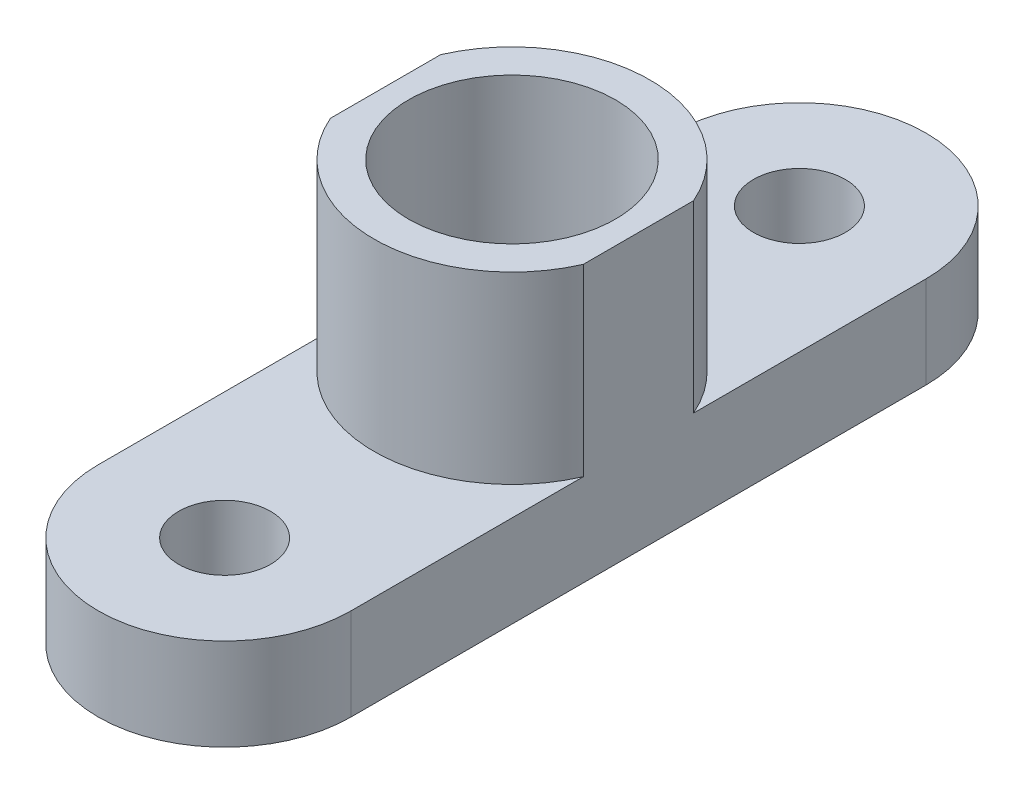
ISO-10303-21;
HEADER;
FILE_DESCRIPTION(('STEP AP214'),'2;1');
FILE_NAME('part.step','',(''),(''),'','','');
FILE_SCHEMA(('AUTOMOTIVE_DESIGN { 1 0 10303 214 1 1 1 1 }'));
ENDSEC;
DATA;
#1=APPLICATION_CONTEXT('core data for automotive mechanical design processes');
#2=APPLICATION_PROTOCOL_DEFINITION('international standard','automotive_design',2000,#1);
#3=PRODUCT_CONTEXT('',#1,'mechanical');
#4=PRODUCT('Part','Part','',(#3));
#5=PRODUCT_RELATED_PRODUCT_CATEGORY('part','',(#4));
#6=PRODUCT_DEFINITION_FORMATION('','',#4);
#7=PRODUCT_DEFINITION_CONTEXT('part definition',#1,'design');
#8=PRODUCT_DEFINITION('design','',#6,#7);
#9=PRODUCT_DEFINITION_SHAPE('','',#8);
#10=(LENGTH_UNIT() NAMED_UNIT(*) SI_UNIT(.MILLI.,.METRE.));
#11=(NAMED_UNIT(*) PLANE_ANGLE_UNIT() SI_UNIT($,.RADIAN.));
#12=(NAMED_UNIT(*) SI_UNIT($,.STERADIAN.) SOLID_ANGLE_UNIT());
#13=UNCERTAINTY_MEASURE_WITH_UNIT(LENGTH_MEASURE(1.E-05),#10,'distance_accuracy_value','');
#14=(GEOMETRIC_REPRESENTATION_CONTEXT(3) GLOBAL_UNCERTAINTY_ASSIGNED_CONTEXT((#13)) GLOBAL_UNIT_ASSIGNED_CONTEXT((#10,
#11,#12)) REPRESENTATION_CONTEXT('',''));
#15=CARTESIAN_POINT('',(0.,0.,0.));
#16=DIRECTION('',(0.,0.,1.));
#17=DIRECTION('',(1.,0.,0.));
#18=AXIS2_PLACEMENT_3D('',#15,#16,#17);
#19=CARTESIAN_POINT('',(0.,16.,0.));
#20=DIRECTION('',(0.,-1.,0.));
#21=DIRECTION('',(0.,0.,-1.));
#22=AXIS2_PLACEMENT_3D('',#19,#20,#21);
#23=CYLINDRICAL_SURFACE('',#22,12.);
#24=CARTESIAN_POINT('',(0.,0.,0.));
#25=DIRECTION('',(0.,1.,0.));
#26=DIRECTION('',(0.,0.,1.));
#27=AXIS2_PLACEMENT_3D('',#24,#25,#26);
#28=CIRCLE('',#27,12.);
#29=CARTESIAN_POINT('',(-11.,0.,4.79583152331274));
#30=VERTEX_POINT('',#29);
#31=CARTESIAN_POINT('',(11.,0.,4.79583152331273));
#32=VERTEX_POINT('',#31);
#33=EDGE_CURVE('E421',#30,#32,#28,.T.);
#34=ORIENTED_EDGE('',*,*,#33,.T.);
#35=DIRECTION('',(0.,-1.,0.));
#36=VECTOR('',#35,1.);
#37=CARTESIAN_POINT('',(11.,16.,4.79583152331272));
#38=LINE('',#37,#36);
#39=CARTESIAN_POINT('',(11.,16.,4.79583152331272));
#40=VERTEX_POINT('',#39);
#41=EDGE_CURVE('E11',#40,#32,#38,.T.);
#42=ORIENTED_EDGE('',*,*,#41,.F.);
#43=CARTESIAN_POINT('',(0.,16.,0.));
#44=DIRECTION('',(0.,1.,0.));
#45=DIRECTION('',(0.,0.,1.));
#46=AXIS2_PLACEMENT_3D('',#43,#44,#45);
#47=CIRCLE('',#46,12.);
#48=CARTESIAN_POINT('',(-11.,16.,4.79583152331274));
#49=VERTEX_POINT('',#48);
#50=EDGE_CURVE('E508',#49,#40,#47,.T.);
#51=ORIENTED_EDGE('',*,*,#50,.F.);
#52=DIRECTION('',(0.,-1.,0.));
#53=VECTOR('',#52,1.);
#54=CARTESIAN_POINT('',(-11.,16.,4.79583152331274));
#55=LINE('',#54,#53);
#56=EDGE_CURVE('E495',#49,#30,#55,.T.);
#57=ORIENTED_EDGE('',*,*,#56,.T.);
#58=EDGE_LOOP('',(#34,#42,#51,#57));
#59=FACE_BOUND('',#58,.T.);
#60=ADVANCED_FACE('F348',(#59),#23,.T.);
#61=CARTESIAN_POINT('',(11.,16.,-4.79583152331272));
#62=DIRECTION('',(-1.,0.,0.));
#63=DIRECTION('',(0.,0.,1.));
#64=AXIS2_PLACEMENT_3D('',#61,#62,#63);
#65=PLANE('',#64);
#66=ORIENTED_EDGE('',*,*,#41,.T.);
#67=DIRECTION('',(0.,0.,1.));
#68=VECTOR('',#67,1.);
#69=CARTESIAN_POINT('',(11.,0.,25.));
#70=LINE('',#69,#68);
#71=CARTESIAN_POINT('',(11.,0.,25.));
#72=VERTEX_POINT('',#71);
#73=EDGE_CURVE('E456',#32,#72,#70,.T.);
#74=ORIENTED_EDGE('',*,*,#73,.T.);
#75=DIRECTION('',(0.,1.,0.));
#76=VECTOR('',#75,1.);
#77=CARTESIAN_POINT('',(11.,-8.,25.));
#78=LINE('',#77,#76);
#79=CARTESIAN_POINT('',(11.,-8.,25.));
#80=VERTEX_POINT('',#79);
#81=EDGE_CURVE('E441',#80,#72,#78,.T.);
#82=ORIENTED_EDGE('',*,*,#81,.F.);
#83=DIRECTION('',(0.,0.,1.));
#84=VECTOR('',#83,1.);
#85=CARTESIAN_POINT('',(11.,-8.,25.));
#86=LINE('',#85,#84);
#87=CARTESIAN_POINT('',(11.,-8.,-25.));
#88=VERTEX_POINT('',#87);
#89=EDGE_CURVE('E467',#88,#80,#86,.T.);
#90=ORIENTED_EDGE('',*,*,#89,.F.);
#91=DIRECTION('',(0.,1.,0.));
#92=VECTOR('',#91,1.);
#93=CARTESIAN_POINT('',(11.,-8.,-25.));
#94=LINE('',#93,#92);
#95=CARTESIAN_POINT('',(11.,0.,-25.));
#96=VERTEX_POINT('',#95);
#97=EDGE_CURVE('E470',#88,#96,#94,.T.);
#98=ORIENTED_EDGE('',*,*,#97,.T.);
#99=CARTESIAN_POINT('',(11.,0.,-4.79583152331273));
#100=VERTEX_POINT('',#99);
#101=EDGE_CURVE('E458',#96,#100,#70,.T.);
#102=ORIENTED_EDGE('',*,*,#101,.T.);
#103=DIRECTION('',(0.,-1.,0.));
#104=VECTOR('',#103,1.);
#105=CARTESIAN_POINT('',(11.,16.,-4.79583152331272));
#106=LINE('',#105,#104);
#107=CARTESIAN_POINT('',(11.,16.,-4.79583152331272));
#108=VERTEX_POINT('',#107);
#109=EDGE_CURVE('E356',#108,#100,#106,.T.);
#110=ORIENTED_EDGE('',*,*,#109,.F.);
#111=DIRECTION('',(0.,0.,-1.));
#112=VECTOR('',#111,1.);
#113=CARTESIAN_POINT('',(11.,16.,-4.79583152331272));
#114=LINE('',#113,#112);
#115=EDGE_CURVE('E513',#40,#108,#114,.T.);
#116=ORIENTED_EDGE('',*,*,#115,.F.);
#117=EDGE_LOOP('',(#66,#74,#82,#90,#98,#102,#110,#116));
#118=FACE_BOUND('',#117,.T.);
#119=ADVANCED_FACE('F489',(#118),#65,.F.);
#120=CARTESIAN_POINT('',(0.,16.,0.));
#121=DIRECTION('',(0.,-1.,0.));
#122=DIRECTION('',(0.,0.,-1.));
#123=AXIS2_PLACEMENT_3D('',#120,#121,#122);
#124=CYLINDRICAL_SURFACE('',#123,12.);
#125=CARTESIAN_POINT('',(0.,0.,0.));
#126=DIRECTION('',(0.,1.,0.));
#127=DIRECTION('',(0.,0.,1.));
#128=AXIS2_PLACEMENT_3D('',#125,#126,#127);
#129=CIRCLE('',#128,12.);
#130=CARTESIAN_POINT('',(-11.,0.,-4.79583152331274));
#131=VERTEX_POINT('',#130);
#132=EDGE_CURVE('E485',#100,#131,#129,.T.);
#133=ORIENTED_EDGE('',*,*,#132,.T.);
#134=DIRECTION('',(0.,-1.,0.));
#135=VECTOR('',#134,1.);
#136=CARTESIAN_POINT('',(-11.,16.,-4.79583152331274));
#137=LINE('',#136,#135);
#138=CARTESIAN_POINT('',(-11.,16.,-4.79583152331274));
#139=VERTEX_POINT('',#138);
#140=EDGE_CURVE('E493',#139,#131,#137,.T.);
#141=ORIENTED_EDGE('',*,*,#140,.F.);
#142=CARTESIAN_POINT('',(0.,16.,0.));
#143=DIRECTION('',(0.,1.,0.));
#144=DIRECTION('',(0.,0.,1.));
#145=AXIS2_PLACEMENT_3D('',#142,#143,#144);
#146=CIRCLE('',#145,12.);
#147=EDGE_CURVE('E369',#108,#139,#146,.T.);
#148=ORIENTED_EDGE('',*,*,#147,.F.);
#149=ORIENTED_EDGE('',*,*,#109,.T.);
#150=EDGE_LOOP('',(#133,#141,#148,#149));
#151=FACE_BOUND('',#150,.T.);
#152=ADVANCED_FACE('F492',(#151),#124,.T.);
#153=CARTESIAN_POINT('',(-11.,16.,-4.79583152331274));
#154=DIRECTION('',(1.,0.,0.));
#155=DIRECTION('',(0.,0.,-1.));
#156=AXIS2_PLACEMENT_3D('',#153,#154,#155);
#157=PLANE('',#156);
#158=ORIENTED_EDGE('',*,*,#140,.T.);
#159=DIRECTION('',(0.,0.,-1.));
#160=VECTOR('',#159,1.);
#161=CARTESIAN_POINT('',(-11.,0.,-25.));
#162=LINE('',#161,#160);
#163=CARTESIAN_POINT('',(-11.,0.,-25.));
#164=VERTEX_POINT('',#163);
#165=EDGE_CURVE('E425',#131,#164,#162,.T.);
#166=ORIENTED_EDGE('',*,*,#165,.T.);
#167=DIRECTION('',(0.,1.,0.));
#168=VECTOR('',#167,1.);
#169=CARTESIAN_POINT('',(-11.,-8.,-25.));
#170=LINE('',#169,#168);
#171=CARTESIAN_POINT('',(-11.,-8.,-25.));
#172=VERTEX_POINT('',#171);
#173=EDGE_CURVE('E436',#172,#164,#170,.T.);
#174=ORIENTED_EDGE('',*,*,#173,.F.);
#175=DIRECTION('',(0.,0.,-1.));
#176=VECTOR('',#175,1.);
#177=CARTESIAN_POINT('',(-11.,-8.,-25.));
#178=LINE('',#177,#176);
#179=CARTESIAN_POINT('',(-11.,-8.,25.));
#180=VERTEX_POINT('',#179);
#181=EDGE_CURVE('E432',#180,#172,#178,.T.);
#182=ORIENTED_EDGE('',*,*,#181,.F.);
#183=DIRECTION('',(0.,1.,0.));
#184=VECTOR('',#183,1.);
#185=CARTESIAN_POINT('',(-11.,-8.,25.));
#186=LINE('',#185,#184);
#187=CARTESIAN_POINT('',(-11.,0.,25.));
#188=VERTEX_POINT('',#187);
#189=EDGE_CURVE('E428',#180,#188,#186,.T.);
#190=ORIENTED_EDGE('',*,*,#189,.T.);
#191=EDGE_CURVE('E414',#188,#30,#162,.T.);
#192=ORIENTED_EDGE('',*,*,#191,.T.);
#193=ORIENTED_EDGE('',*,*,#56,.F.);
#194=DIRECTION('',(0.,0.,1.));
#195=VECTOR('',#194,1.);
#196=CARTESIAN_POINT('',(-11.,16.,-4.79583152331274));
#197=LINE('',#196,#195);
#198=EDGE_CURVE('E364',#139,#49,#197,.T.);
#199=ORIENTED_EDGE('',*,*,#198,.F.);
#200=EDGE_LOOP('',(#158,#166,#174,#182,#190,#192,#193,#199));
#201=FACE_BOUND('',#200,.T.);
#202=ADVANCED_FACE('F430',(#201),#157,.F.);
#203=CARTESIAN_POINT('',(0.,16.,0.));
#204=DIRECTION('',(0.,1.,0.));
#205=DIRECTION('',(0.,0.,1.));
#206=AXIS2_PLACEMENT_3D('',#203,#204,#205);
#207=PLANE('',#206);
#208=CARTESIAN_POINT('',(0.,16.,0.));
#209=DIRECTION('',(0.,1.,0.));
#210=DIRECTION('',(0.,0.,1.));
#211=AXIS2_PLACEMENT_3D('',#208,#209,#210);
#212=CIRCLE('',#211,9.);
#213=CARTESIAN_POINT('',(0.,16.,9.));
#214=VERTEX_POINT('',#213);
#215=EDGE_CURVE('E537',#214,#214,#212,.T.);
#216=ORIENTED_EDGE('',*,*,#215,.F.);
#217=EDGE_LOOP('',(#216));
#218=FACE_BOUND('',#217,.T.);
#219=ORIENTED_EDGE('',*,*,#50,.T.);
#220=ORIENTED_EDGE('',*,*,#115,.T.);
#221=ORIENTED_EDGE('',*,*,#147,.T.);
#222=ORIENTED_EDGE('',*,*,#198,.T.);
#223=EDGE_LOOP('',(#219,#220,#221,#222));
#224=FACE_BOUND('',#223,.T.);
#225=ADVANCED_FACE('F516',(#218,#224),#207,.T.);
#226=CARTESIAN_POINT('',(0.,0.,25.));
#227=DIRECTION('',(0.,-1.,0.));
#228=DIRECTION('',(0.,0.,-1.));
#229=AXIS2_PLACEMENT_3D('',#226,#227,#228);
#230=PLANE('',#229);
#231=ORIENTED_EDGE('',*,*,#33,.F.);
#232=ORIENTED_EDGE('',*,*,#191,.F.);
#233=CARTESIAN_POINT('',(0.,0.,25.));
#234=DIRECTION('',(0.,-1.,0.));
#235=DIRECTION('',(0.,0.,-1.));
#236=AXIS2_PLACEMENT_3D('',#233,#234,#235);
#237=CIRCLE('',#236,11.);
#238=EDGE_CURVE('E419',#72,#188,#237,.T.);
#239=ORIENTED_EDGE('',*,*,#238,.F.);
#240=ORIENTED_EDGE('',*,*,#73,.F.);
#241=EDGE_LOOP('',(#231,#232,#239,#240));
#242=FACE_BOUND('',#241,.T.);
#243=CARTESIAN_POINT('',(0.,0.,25.));
#244=DIRECTION('',(0.,-1.,0.));
#245=DIRECTION('',(0.,0.,-1.));
#246=AXIS2_PLACEMENT_3D('',#243,#244,#245);
#247=CIRCLE('',#246,4.);
#248=CARTESIAN_POINT('',(0.,0.,21.));
#249=VERTEX_POINT('',#248);
#250=EDGE_CURVE('E528',#249,#249,#247,.T.);
#251=ORIENTED_EDGE('',*,*,#250,.T.);
#252=EDGE_LOOP('',(#251));
#253=FACE_BOUND('',#252,.T.);
#254=ADVANCED_FACE('F416',(#242,#253),#230,.F.);
#255=CARTESIAN_POINT('',(0.,-8.,25.));
#256=DIRECTION('',(0.,-1.,0.));
#257=DIRECTION('',(0.,0.,-1.));
#258=AXIS2_PLACEMENT_3D('',#255,#256,#257);
#259=PLANE('',#258);
#260=CARTESIAN_POINT('',(0.,-8.,0.));
#261=DIRECTION('',(0.,1.,0.));
#262=DIRECTION('',(0.,0.,1.));
#263=AXIS2_PLACEMENT_3D('',#260,#261,#262);
#264=CIRCLE('',#263,9.);
#265=CARTESIAN_POINT('',(0.,-8.,9.));
#266=VERTEX_POINT('',#265);
#267=EDGE_CURVE('E532',#266,#266,#264,.T.);
#268=ORIENTED_EDGE('',*,*,#267,.T.);
#269=EDGE_LOOP('',(#268));
#270=FACE_BOUND('',#269,.T.);
#271=CARTESIAN_POINT('',(0.,-8.,-25.));
#272=DIRECTION('',(0.,-1.,0.));
#273=DIRECTION('',(0.,0.,-1.));
#274=AXIS2_PLACEMENT_3D('',#271,#272,#273);
#275=CIRCLE('',#274,4.);
#276=CARTESIAN_POINT('',(0.,-8.,-29.));
#277=VERTEX_POINT('',#276);
#278=EDGE_CURVE('E442',#277,#277,#275,.T.);
#279=ORIENTED_EDGE('',*,*,#278,.F.);
#280=EDGE_LOOP('',(#279));
#281=FACE_BOUND('',#280,.T.);
#282=CARTESIAN_POINT('',(0.,-8.,25.));
#283=DIRECTION('',(0.,-1.,0.));
#284=DIRECTION('',(0.,0.,-1.));
#285=AXIS2_PLACEMENT_3D('',#282,#283,#284);
#286=CIRCLE('',#285,11.);
#287=EDGE_CURVE('E461',#80,#180,#286,.T.);
#288=ORIENTED_EDGE('',*,*,#287,.T.);
#289=ORIENTED_EDGE('',*,*,#181,.T.);
#290=CARTESIAN_POINT('',(0.,-8.,-25.));
#291=DIRECTION('',(0.,-1.,0.));
#292=DIRECTION('',(0.,0.,-1.));
#293=AXIS2_PLACEMENT_3D('',#290,#291,#292);
#294=CIRCLE('',#293,11.);
#295=EDGE_CURVE('E465',#172,#88,#294,.T.);
#296=ORIENTED_EDGE('',*,*,#295,.T.);
#297=ORIENTED_EDGE('',*,*,#89,.T.);
#298=EDGE_LOOP('',(#288,#289,#296,#297));
#299=FACE_BOUND('',#298,.T.);
#300=CARTESIAN_POINT('',(0.,-8.,25.));
#301=DIRECTION('',(0.,-1.,0.));
#302=DIRECTION('',(0.,0.,-1.));
#303=AXIS2_PLACEMENT_3D('',#300,#301,#302);
#304=CIRCLE('',#303,4.);
#305=CARTESIAN_POINT('',(0.,-8.,21.));
#306=VERTEX_POINT('',#305);
#307=EDGE_CURVE('E526',#306,#306,#304,.T.);
#308=ORIENTED_EDGE('',*,*,#307,.F.);
#309=EDGE_LOOP('',(#308));
#310=FACE_BOUND('',#309,.T.);
#311=ADVANCED_FACE('F519',(#270,#281,#299,#310),#259,.T.);
#312=ORIENTED_EDGE('',*,*,#132,.F.);
#313=ORIENTED_EDGE('',*,*,#101,.F.);
#314=CARTESIAN_POINT('',(0.,0.,-25.));
#315=DIRECTION('',(0.,-1.,0.));
#316=DIRECTION('',(0.,0.,-1.));
#317=AXIS2_PLACEMENT_3D('',#314,#315,#316);
#318=CIRCLE('',#317,11.);
#319=EDGE_CURVE('E424',#164,#96,#318,.T.);
#320=ORIENTED_EDGE('',*,*,#319,.F.);
#321=ORIENTED_EDGE('',*,*,#165,.F.);
#322=EDGE_LOOP('',(#312,#313,#320,#321));
#323=FACE_BOUND('',#322,.T.);
#324=CARTESIAN_POINT('',(0.,0.,-25.));
#325=DIRECTION('',(0.,-1.,0.));
#326=DIRECTION('',(0.,0.,-1.));
#327=AXIS2_PLACEMENT_3D('',#324,#325,#326);
#328=CIRCLE('',#327,4.);
#329=CARTESIAN_POINT('',(0.,0.,-29.));
#330=VERTEX_POINT('',#329);
#331=EDGE_CURVE('E446',#330,#330,#328,.T.);
#332=ORIENTED_EDGE('',*,*,#331,.T.);
#333=EDGE_LOOP('',(#332));
#334=FACE_BOUND('',#333,.T.);
#335=ADVANCED_FACE('F481',(#323,#334),#230,.F.);
#336=CARTESIAN_POINT('',(0.,-8.,25.));
#337=DIRECTION('',(0.,1.,0.));
#338=DIRECTION('',(0.,0.,1.));
#339=AXIS2_PLACEMENT_3D('',#336,#337,#338);
#340=CYLINDRICAL_SURFACE('',#339,11.);
#341=ORIENTED_EDGE('',*,*,#238,.T.);
#342=ORIENTED_EDGE('',*,*,#189,.F.);
#343=ORIENTED_EDGE('',*,*,#287,.F.);
#344=ORIENTED_EDGE('',*,*,#81,.T.);
#345=EDGE_LOOP('',(#341,#342,#343,#344));
#346=FACE_BOUND('',#345,.T.);
#347=ADVANCED_FACE('F439',(#346),#340,.T.);
#348=CARTESIAN_POINT('',(0.,-8.,-25.));
#349=DIRECTION('',(0.,1.,0.));
#350=DIRECTION('',(0.,0.,1.));
#351=AXIS2_PLACEMENT_3D('',#348,#349,#350);
#352=CYLINDRICAL_SURFACE('',#351,11.);
#353=ORIENTED_EDGE('',*,*,#319,.T.);
#354=ORIENTED_EDGE('',*,*,#97,.F.);
#355=ORIENTED_EDGE('',*,*,#295,.F.);
#356=ORIENTED_EDGE('',*,*,#173,.T.);
#357=EDGE_LOOP('',(#353,#354,#355,#356));
#358=FACE_BOUND('',#357,.T.);
#359=ADVANCED_FACE('F477',(#358),#352,.T.);
#360=CARTESIAN_POINT('',(0.,-8.,-25.));
#361=DIRECTION('',(0.,1.,0.));
#362=DIRECTION('',(0.,0.,1.));
#363=AXIS2_PLACEMENT_3D('',#360,#361,#362);
#364=CYLINDRICAL_SURFACE('',#363,4.);
#365=ORIENTED_EDGE('',*,*,#278,.T.);
#366=EDGE_LOOP('',(#365));
#367=FACE_BOUND('',#366,.T.);
#368=ORIENTED_EDGE('',*,*,#331,.F.);
#369=EDGE_LOOP('',(#368));
#370=FACE_BOUND('',#369,.T.);
#371=ADVANCED_FACE('F590',(#367,#370),#364,.F.);
#372=CARTESIAN_POINT('',(0.,-8.,25.));
#373=DIRECTION('',(0.,1.,0.));
#374=DIRECTION('',(0.,0.,1.));
#375=AXIS2_PLACEMENT_3D('',#372,#373,#374);
#376=CYLINDRICAL_SURFACE('',#375,4.);
#377=ORIENTED_EDGE('',*,*,#307,.T.);
#378=EDGE_LOOP('',(#377));
#379=FACE_BOUND('',#378,.T.);
#380=ORIENTED_EDGE('',*,*,#250,.F.);
#381=EDGE_LOOP('',(#380));
#382=FACE_BOUND('',#381,.T.);
#383=ADVANCED_FACE('F596',(#379,#382),#376,.F.);
#384=CARTESIAN_POINT('',(0.,-8.,0.));
#385=DIRECTION('',(0.,1.,0.));
#386=DIRECTION('',(0.,0.,1.));
#387=AXIS2_PLACEMENT_3D('',#384,#385,#386);
#388=CYLINDRICAL_SURFACE('',#387,9.);
#389=ORIENTED_EDGE('',*,*,#267,.F.);
#390=EDGE_LOOP('',(#389));
#391=FACE_BOUND('',#390,.T.);
#392=ORIENTED_EDGE('',*,*,#215,.T.);
#393=EDGE_LOOP('',(#392));
#394=FACE_BOUND('',#393,.T.);
#395=ADVANCED_FACE('F541',(#391,#394),#388,.F.);
#396=CLOSED_SHELL('',(#60,#119,#152,#202,#225,#254,#311,#335,#347,#359,#371,#383,#395));
#397=MANIFOLD_SOLID_BREP('B2',#396);
#398=ADVANCED_BREP_SHAPE_REPRESENTATION('',(#18,#397),#14);
#399=SHAPE_DEFINITION_REPRESENTATION(#9,#398);
ENDSEC;
END-ISO-10303-21;
